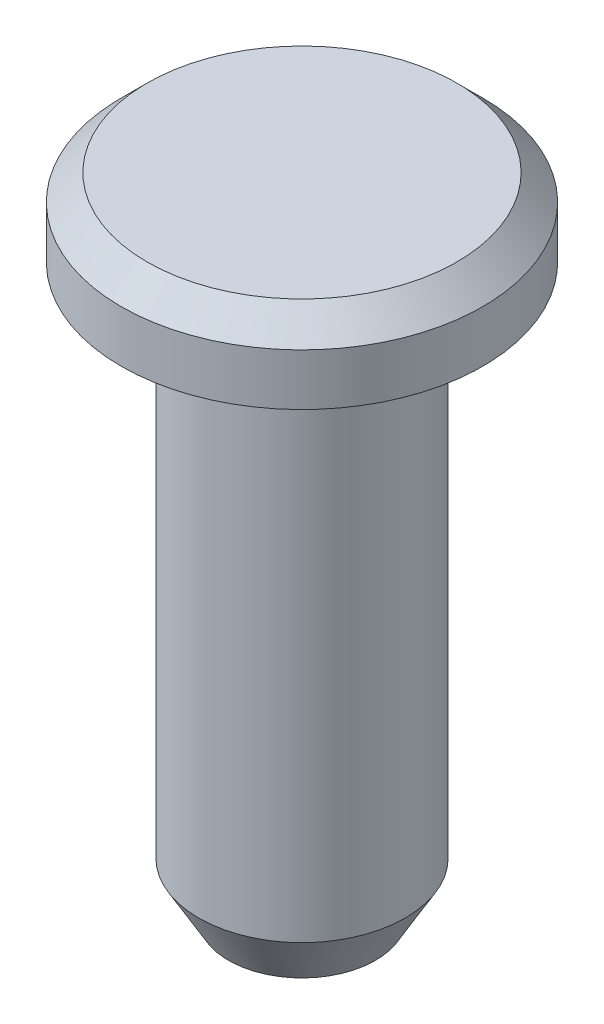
from build123d import *

# Parameters (mm, degrees)
SFAZOWANIE1_SIZE  = 1
SFAZOWANIE2_SIZE  = 2
SFAZOWANIE2_SIZE2 = 1.154700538


with BuildPart() as part:
    # Szkic1 → Obr_t1 (revolve)
    with BuildSketch(Plane.XY, mode=Mode.PRIVATE) as obr_t1_sk:
        Polygon((0, 0), (-4, 0), (-4, 22), (-7, 22), (-7, 25), (0, 25), align=None)
    revolve(obr_t1_sk.sketch.rotate(Axis((0, 0, 0), (0, -1, 0)), 270), axis=Axis((0, 0, 0), (0, -1, 0)))

    # Sfazowanie1
    sfazowanie1_edges = [part.edges().sort_by_distance(p)[0] for p in [
        (0, 25, -7),
    ]]
    chamfer(sfazowanie1_edges, length=SFAZOWANIE1_SIZE)

    # Sfazowanie2
    sfazowanie2_edges = [part.edges().sort_by_distance(p)[0] for p in [
        (0, 0, -4),
    ]]
    sfazowanie2_side = [part.faces().sort_by_distance(p)[0] for p in [
        (0, 11, -4),
    ]]
    chamfer(sfazowanie2_edges, length=SFAZOWANIE2_SIZE, length2=SFAZOWANIE2_SIZE2, reference=sfazowanie2_side[0])


solid = part.part
